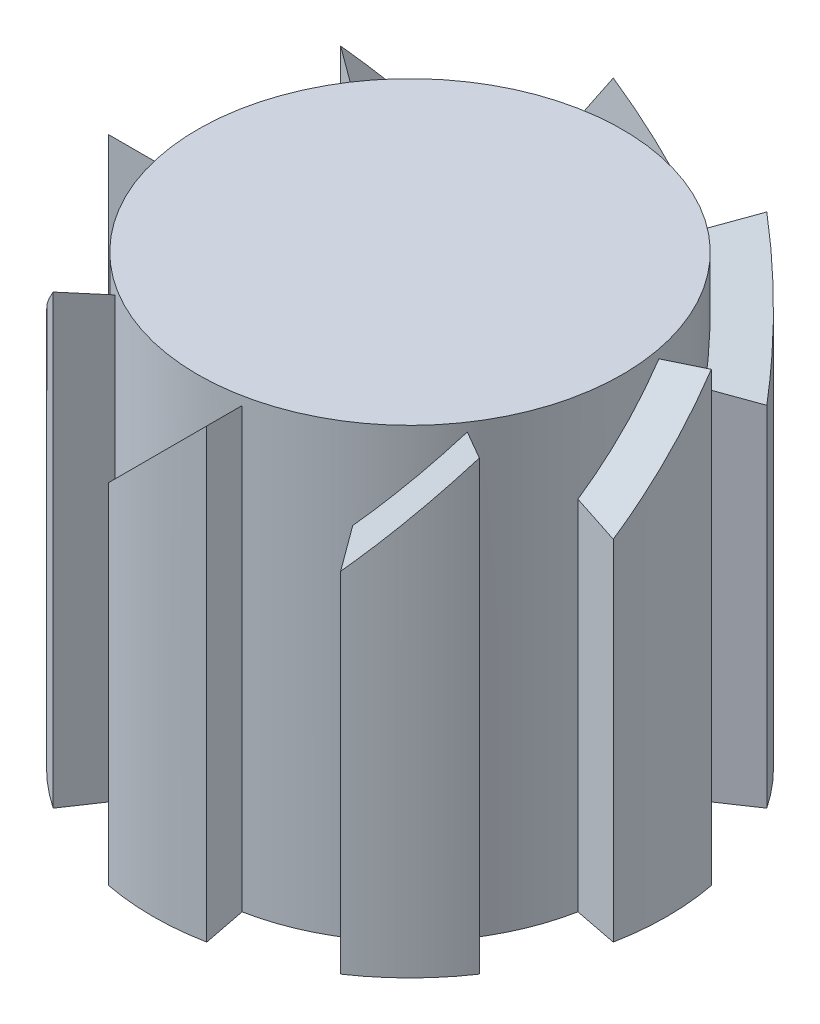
ISO-10303-21;
HEADER;
FILE_DESCRIPTION(('STEP AP214'),'2;1');
FILE_NAME('part.step','',(''),(''),'','','');
FILE_SCHEMA(('AUTOMOTIVE_DESIGN { 1 0 10303 214 1 1 1 1 }'));
ENDSEC;
DATA;
#1=APPLICATION_CONTEXT('core data for automotive mechanical design processes');
#2=APPLICATION_PROTOCOL_DEFINITION('international standard','automotive_design',2000,#1);
#3=PRODUCT_CONTEXT('',#1,'mechanical');
#4=PRODUCT('Part','Part','',(#3));
#5=PRODUCT_RELATED_PRODUCT_CATEGORY('part','',(#4));
#6=PRODUCT_DEFINITION_FORMATION('','',#4);
#7=PRODUCT_DEFINITION_CONTEXT('part definition',#1,'design');
#8=PRODUCT_DEFINITION('design','',#6,#7);
#9=PRODUCT_DEFINITION_SHAPE('','',#8);
#10=(LENGTH_UNIT() NAMED_UNIT(*) SI_UNIT(.MILLI.,.METRE.));
#11=(NAMED_UNIT(*) PLANE_ANGLE_UNIT() SI_UNIT($,.RADIAN.));
#12=(NAMED_UNIT(*) SI_UNIT($,.STERADIAN.) SOLID_ANGLE_UNIT());
#13=UNCERTAINTY_MEASURE_WITH_UNIT(LENGTH_MEASURE(1.E-05),#10,'distance_accuracy_value','');
#14=(GEOMETRIC_REPRESENTATION_CONTEXT(3) GLOBAL_UNCERTAINTY_ASSIGNED_CONTEXT((#13)) GLOBAL_UNIT_ASSIGNED_CONTEXT((#10,
#11,#12)) REPRESENTATION_CONTEXT('',''));
#15=CARTESIAN_POINT('',(0.,0.,0.));
#16=DIRECTION('',(0.,0.,1.));
#17=DIRECTION('',(1.,0.,0.));
#18=AXIS2_PLACEMENT_3D('',#15,#16,#17);
#19=CARTESIAN_POINT('',(0.,10.,0.));
#20=DIRECTION('',(0.,-1.,0.));
#21=DIRECTION('',(0.,0.,-1.));
#22=AXIS2_PLACEMENT_3D('',#19,#20,#21);
#23=CYLINDRICAL_SURFACE('',#22,4.75);
#24=CARTESIAN_POINT('',(0.,10.,0.));
#25=DIRECTION('',(0.,1.,0.));
#26=DIRECTION('',(0.,0.,1.));
#27=AXIS2_PLACEMENT_3D('',#24,#25,#26);
#28=CIRCLE('',#27,4.75);
#29=CARTESIAN_POINT('',(0.,10.,4.75));
#30=VERTEX_POINT('',#29);
#31=EDGE_CURVE('E398',#30,#30,#28,.T.);
#32=ORIENTED_EDGE('',*,*,#31,.F.);
#33=EDGE_LOOP('',(#32));
#34=FACE_BOUND('',#33,.T.);
#35=CARTESIAN_POINT('',(0.,8.9028482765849,0.));
#36=DIRECTION('',(-0.499999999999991,-0.707106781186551,-0.500000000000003));
#37=DIRECTION('',(0.499999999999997,-0.707106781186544,0.500000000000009));
#38=AXIS2_PLACEMENT_3D('',#35,#36,#37);
#39=ELLIPSE('',#38,6.71751442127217,4.75);
#40=CARTESIAN_POINT('',(3.93792846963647,7.99650554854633,-2.65616629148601));
#41=VERTEX_POINT('',#40);
#42=CARTESIAN_POINT('',(2.65616629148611,9.80919100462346,-3.93792846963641));
#43=VERTEX_POINT('',#42);
#44=EDGE_CURVE('E238',#41,#43,#39,.F.);
#45=ORIENTED_EDGE('',*,*,#44,.T.);
#46=DIRECTION('',(0.,-1.,0.));
#47=VECTOR('',#46,1.);
#48=CARTESIAN_POINT('',(2.65616629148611,10.,-3.93792846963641));
#49=LINE('',#48,#47);
#50=CARTESIAN_POINT('',(2.65616629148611,0.,-3.93792846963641));
#51=VERTEX_POINT('',#50);
#52=EDGE_CURVE('E257',#43,#51,#49,.T.);
#53=ORIENTED_EDGE('',*,*,#52,.T.);
#54=CARTESIAN_POINT('',(0.,0.,0.));
#55=DIRECTION('',(0.,1.,0.));
#56=DIRECTION('',(0.,0.,1.));
#57=AXIS2_PLACEMENT_3D('',#54,#55,#56);
#58=CIRCLE('',#57,4.75);
#59=CARTESIAN_POINT('',(0.906342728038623,0.,-4.6627291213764));
#60=VERTEX_POINT('',#59);
#61=EDGE_CURVE('E403',#51,#60,#58,.T.);
#62=ORIENTED_EDGE('',*,*,#61,.T.);
#63=DIRECTION('',(0.,-1.,0.));
#64=VECTOR('',#63,1.);
#65=CARTESIAN_POINT('',(0.906342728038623,10.,-4.6627291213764));
#66=LINE('',#65,#64);
#67=CARTESIAN_POINT('',(0.906342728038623,7.99650554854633,-4.6627291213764));
#68=VERTEX_POINT('',#67);
#69=EDGE_CURVE('E271',#60,#68,#66,.F.);
#70=ORIENTED_EDGE('',*,*,#69,.T.);
#71=CARTESIAN_POINT('',(0.,8.9028482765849,0.));
#72=DIRECTION('',(-0.707106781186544,-0.707106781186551,0.));
#73=DIRECTION('',(0.707106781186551,-0.707106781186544,0.));
#74=AXIS2_PLACEMENT_3D('',#71,#72,#73);
#75=ELLIPSE('',#74,6.71751442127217,4.75);
#76=CARTESIAN_POINT('',(-0.906342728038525,9.80919100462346,-4.66272912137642));
#77=VERTEX_POINT('',#76);
#78=EDGE_CURVE('E514',#68,#77,#75,.F.);
#79=ORIENTED_EDGE('',*,*,#78,.T.);
#80=DIRECTION('',(0.,-1.,0.));
#81=VECTOR('',#80,1.);
#82=CARTESIAN_POINT('',(-0.906342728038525,10.,-4.66272912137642));
#83=LINE('',#82,#81);
#84=CARTESIAN_POINT('',(-0.906342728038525,0.,-4.66272912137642));
#85=VERTEX_POINT('',#84);
#86=EDGE_CURVE('E280',#77,#85,#83,.T.);
#87=ORIENTED_EDGE('',*,*,#86,.T.);
#88=CARTESIAN_POINT('',(-2.65616629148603,0.,-3.93792846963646));
#89=VERTEX_POINT('',#88);
#90=EDGE_CURVE('E434',#85,#89,#58,.T.);
#91=ORIENTED_EDGE('',*,*,#90,.T.);
#92=DIRECTION('',(0.,-1.,0.));
#93=VECTOR('',#92,1.);
#94=CARTESIAN_POINT('',(-2.65616629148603,10.,-3.93792846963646));
#95=LINE('',#94,#93);
#96=CARTESIAN_POINT('',(-2.65616629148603,7.99650554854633,-3.93792846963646));
#97=VERTEX_POINT('',#96);
#98=EDGE_CURVE('E293',#89,#97,#95,.F.);
#99=ORIENTED_EDGE('',*,*,#98,.T.);
#100=CARTESIAN_POINT('',(0.,8.9028482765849,0.));
#101=DIRECTION('',(-0.500000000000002,-0.707106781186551,0.499999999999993));
#102=DIRECTION('',(0.500000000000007,-0.707106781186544,-0.499999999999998));
#103=AXIS2_PLACEMENT_3D('',#100,#101,#102);
#104=ELLIPSE('',#103,6.71751442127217,4.75);
#105=CARTESIAN_POINT('',(-3.93792846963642,9.80919100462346,-2.65616629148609));
#106=VERTEX_POINT('',#105);
#107=EDGE_CURVE('E426',#97,#106,#104,.F.);
#108=ORIENTED_EDGE('',*,*,#107,.T.);
#109=DIRECTION('',(0.,-1.,0.));
#110=VECTOR('',#109,1.);
#111=CARTESIAN_POINT('',(-3.93792846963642,10.,-2.65616629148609));
#112=LINE('',#111,#110);
#113=CARTESIAN_POINT('',(-3.93792846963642,0.,-2.65616629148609));
#114=VERTEX_POINT('',#113);
#115=EDGE_CURVE('E298',#106,#114,#112,.T.);
#116=ORIENTED_EDGE('',*,*,#115,.T.);
#117=CARTESIAN_POINT('',(-4.66272912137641,0.,-0.906342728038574));
#118=VERTEX_POINT('',#117);
#119=EDGE_CURVE('E437',#114,#118,#58,.T.);
#120=ORIENTED_EDGE('',*,*,#119,.T.);
#121=DIRECTION('',(0.,-1.,0.));
#122=VECTOR('',#121,1.);
#123=CARTESIAN_POINT('',(-4.66272912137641,10.,-0.906342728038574));
#124=LINE('',#123,#122);
#125=CARTESIAN_POINT('',(-4.66272912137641,7.99650554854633,-0.906342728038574));
#126=VERTEX_POINT('',#125);
#127=EDGE_CURVE('E307',#118,#126,#124,.F.);
#128=ORIENTED_EDGE('',*,*,#127,.T.);
#129=CARTESIAN_POINT('',(0.,8.9028482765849,0.));
#130=DIRECTION('',(0.,-0.707106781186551,0.707106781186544));
#131=DIRECTION('',(0.,-0.707106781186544,-0.707106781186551));
#132=AXIS2_PLACEMENT_3D('',#129,#130,#131);
#133=ELLIPSE('',#132,6.71751442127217,4.75);
#134=CARTESIAN_POINT('',(-4.66272912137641,9.80919100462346,0.906342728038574));
#135=VERTEX_POINT('',#134);
#136=EDGE_CURVE('E504',#126,#135,#133,.F.);
#137=ORIENTED_EDGE('',*,*,#136,.T.);
#138=DIRECTION('',(0.,-1.,0.));
#139=VECTOR('',#138,1.);
#140=CARTESIAN_POINT('',(-4.66272912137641,10.,0.906342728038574));
#141=LINE('',#140,#139);
#142=CARTESIAN_POINT('',(-4.66272912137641,0.,0.906342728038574));
#143=VERTEX_POINT('',#142);
#144=EDGE_CURVE('E316',#135,#143,#141,.T.);
#145=ORIENTED_EDGE('',*,*,#144,.T.);
#146=CARTESIAN_POINT('',(-3.93792846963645,0.,2.65616629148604));
#147=VERTEX_POINT('',#146);
#148=EDGE_CURVE('E438',#143,#147,#58,.T.);
#149=ORIENTED_EDGE('',*,*,#148,.T.);
#150=DIRECTION('',(0.,-1.,0.));
#151=VECTOR('',#150,1.);
#152=CARTESIAN_POINT('',(-3.93792846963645,10.,2.65616629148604));
#153=LINE('',#152,#151);
#154=CARTESIAN_POINT('',(-3.93792846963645,7.99650554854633,2.65616629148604));
#155=VERTEX_POINT('',#154);
#156=EDGE_CURVE('E329',#147,#155,#153,.F.);
#157=ORIENTED_EDGE('',*,*,#156,.T.);
#158=CARTESIAN_POINT('',(0.,8.9028482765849,0.));
#159=DIRECTION('',(0.499999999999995,-0.707106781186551,0.5));
#160=DIRECTION('',(-0.5,-0.707106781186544,-0.500000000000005));
#161=AXIS2_PLACEMENT_3D('',#158,#159,#160);
#162=ELLIPSE('',#161,6.71751442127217,4.75);
#163=CARTESIAN_POINT('',(-2.65616629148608,9.80919100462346,3.93792846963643));
#164=VERTEX_POINT('',#163);
#165=EDGE_CURVE('E497',#155,#164,#162,.F.);
#166=ORIENTED_EDGE('',*,*,#165,.T.);
#167=DIRECTION('',(0.,-1.,0.));
#168=VECTOR('',#167,1.);
#169=CARTESIAN_POINT('',(-2.65616629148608,10.,3.93792846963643));
#170=LINE('',#169,#168);
#171=CARTESIAN_POINT('',(-2.65616629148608,0.,3.93792846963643));
#172=VERTEX_POINT('',#171);
#173=EDGE_CURVE('E334',#164,#172,#170,.T.);
#174=ORIENTED_EDGE('',*,*,#173,.T.);
#175=CARTESIAN_POINT('',(-0.90634272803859,0.,4.6627291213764));
#176=VERTEX_POINT('',#175);
#177=EDGE_CURVE('E441',#172,#176,#58,.T.);
#178=ORIENTED_EDGE('',*,*,#177,.T.);
#179=DIRECTION('',(0.,-1.,0.));
#180=VECTOR('',#179,1.);
#181=CARTESIAN_POINT('',(-0.90634272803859,10.,4.6627291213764));
#182=LINE('',#181,#180);
#183=CARTESIAN_POINT('',(-0.90634272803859,7.99650554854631,4.6627291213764));
#184=VERTEX_POINT('',#183);
#185=EDGE_CURVE('E343',#176,#184,#182,.F.);
#186=ORIENTED_EDGE('',*,*,#185,.T.);
#187=CARTESIAN_POINT('',(0.,8.90284827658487,0.));
#188=DIRECTION('',(0.707106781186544,-0.707106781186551,0.));
#189=DIRECTION('',(-0.707106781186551,-0.707106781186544,0.));
#190=AXIS2_PLACEMENT_3D('',#187,#188,#189);
#191=ELLIPSE('',#190,6.71751442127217,4.75);
#192=CARTESIAN_POINT('',(0.906342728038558,9.80919100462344,4.66272912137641));
#193=VERTEX_POINT('',#192);
#194=EDGE_CURVE('E490',#184,#193,#191,.F.);
#195=ORIENTED_EDGE('',*,*,#194,.T.);
#196=DIRECTION('',(0.,-1.,0.));
#197=VECTOR('',#196,1.);
#198=CARTESIAN_POINT('',(0.906342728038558,10.,4.66272912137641));
#199=LINE('',#198,#197);
#200=CARTESIAN_POINT('',(0.906342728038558,0.,4.66272912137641));
#201=VERTEX_POINT('',#200);
#202=EDGE_CURVE('E352',#193,#201,#199,.T.);
#203=ORIENTED_EDGE('',*,*,#202,.T.);
#204=CARTESIAN_POINT('',(2.65616629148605,0.,3.93792846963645));
#205=VERTEX_POINT('',#204);
#206=EDGE_CURVE('E444',#201,#205,#58,.T.);
#207=ORIENTED_EDGE('',*,*,#206,.T.);
#208=DIRECTION('',(0.,-1.,0.));
#209=VECTOR('',#208,1.);
#210=CARTESIAN_POINT('',(2.65616629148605,10.,3.93792846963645));
#211=LINE('',#210,#209);
#212=CARTESIAN_POINT('',(2.65616629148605,7.99650554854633,3.93792846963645));
#213=VERTEX_POINT('',#212);
#214=EDGE_CURVE('E365',#205,#213,#211,.F.);
#215=ORIENTED_EDGE('',*,*,#214,.T.);
#216=CARTESIAN_POINT('',(0.,8.9028482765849,0.));
#217=DIRECTION('',(0.499999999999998,-0.707106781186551,-0.499999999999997));
#218=DIRECTION('',(-0.500000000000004,-0.707106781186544,0.500000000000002));
#219=AXIS2_PLACEMENT_3D('',#216,#217,#218);
#220=ELLIPSE('',#219,6.71751442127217,4.75);
#221=CARTESIAN_POINT('',(3.93792846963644,9.80919100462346,2.65616629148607));
#222=VERTEX_POINT('',#221);
#223=EDGE_CURVE('E484',#213,#222,#220,.F.);
#224=ORIENTED_EDGE('',*,*,#223,.T.);
#225=DIRECTION('',(0.,-1.,0.));
#226=VECTOR('',#225,1.);
#227=CARTESIAN_POINT('',(3.93792846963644,10.,2.65616629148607));
#228=LINE('',#227,#226);
#229=CARTESIAN_POINT('',(3.93792846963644,0.,2.65616629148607));
#230=VERTEX_POINT('',#229);
#231=EDGE_CURVE('E370',#222,#230,#228,.T.);
#232=ORIENTED_EDGE('',*,*,#231,.T.);
#233=CARTESIAN_POINT('',(4.66272912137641,0.,0.906342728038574));
#234=VERTEX_POINT('',#233);
#235=EDGE_CURVE('E397',#230,#234,#58,.T.);
#236=ORIENTED_EDGE('',*,*,#235,.T.);
#237=DIRECTION('',(0.,-1.,0.));
#238=VECTOR('',#237,1.);
#239=CARTESIAN_POINT('',(4.66272912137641,10.,0.906342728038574));
#240=LINE('',#239,#238);
#241=CARTESIAN_POINT('',(4.66272912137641,7.99650554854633,0.906342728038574));
#242=VERTEX_POINT('',#241);
#243=EDGE_CURVE('E390',#234,#242,#240,.F.);
#244=ORIENTED_EDGE('',*,*,#243,.T.);
#245=CARTESIAN_POINT('',(0.,8.9028482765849,0.));
#246=DIRECTION('',(0.,-0.707106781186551,-0.707106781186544));
#247=DIRECTION('',(0.,-0.707106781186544,0.707106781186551));
#248=AXIS2_PLACEMENT_3D('',#245,#246,#247);
#249=ELLIPSE('',#248,6.71751442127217,4.75);
#250=CARTESIAN_POINT('',(4.66272912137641,9.80919100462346,-0.906342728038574));
#251=VERTEX_POINT('',#250);
#252=EDGE_CURVE('E372',#242,#251,#249,.F.);
#253=ORIENTED_EDGE('',*,*,#252,.T.);
#254=DIRECTION('',(0.,-1.,0.));
#255=VECTOR('',#254,1.);
#256=CARTESIAN_POINT('',(4.66272912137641,10.,-0.906342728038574));
#257=LINE('',#256,#255);
#258=CARTESIAN_POINT('',(4.66272912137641,0.,-0.906342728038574));
#259=VERTEX_POINT('',#258);
#260=EDGE_CURVE('E395',#251,#259,#257,.T.);
#261=ORIENTED_EDGE('',*,*,#260,.T.);
#262=CARTESIAN_POINT('',(3.93792846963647,0.,-2.65616629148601));
#263=VERTEX_POINT('',#262);
#264=EDGE_CURVE('E256',#259,#263,#58,.T.);
#265=ORIENTED_EDGE('',*,*,#264,.T.);
#266=DIRECTION('',(0.,-1.,0.));
#267=VECTOR('',#266,1.);
#268=CARTESIAN_POINT('',(3.93792846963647,10.,-2.65616629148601));
#269=LINE('',#268,#267);
#270=EDGE_CURVE('E250',#263,#41,#269,.F.);
#271=ORIENTED_EDGE('',*,*,#270,.T.);
#272=EDGE_LOOP('',(#45,#53,#62,#70,#79,#87,#91,#99,#108,#116,#120,#128,#137,#145,#149,#157,#166,
#174,#178,#186,#195,#203,#207,#215,#224,#232,#236,#244,#253,#261,#265,#271));
#273=FACE_BOUND('',#272,.T.);
#274=ADVANCED_FACE('F33',(#34,#273),#23,.T.);
#275=CARTESIAN_POINT('',(0.,10.,0.));
#276=DIRECTION('',(0.,1.,0.));
#277=DIRECTION('',(0.,0.,1.));
#278=AXIS2_PLACEMENT_3D('',#275,#276,#277);
#279=PLANE('',#278);
#280=ORIENTED_EDGE('',*,*,#31,.T.);
#281=EDGE_LOOP('',(#280));
#282=FACE_BOUND('',#281,.T.);
#283=ADVANCED_FACE('F531',(#282),#279,.T.);
#284=CARTESIAN_POINT('',(0.,0.,0.));
#285=DIRECTION('',(0.,1.,0.));
#286=DIRECTION('',(0.,0.,1.));
#287=AXIS2_PLACEMENT_3D('',#284,#285,#286);
#288=PLANE('',#287);
#289=ORIENTED_EDGE('',*,*,#61,.F.);
#290=DIRECTION('',(0.559192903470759,0.,-0.829037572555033));
#291=VECTOR('',#290,1.);
#292=CARTESIAN_POINT('',(3.21535919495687,0.,-4.76696604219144));
#293=LINE('',#292,#291);
#294=CARTESIAN_POINT('',(3.21535919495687,0.,-4.76696604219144));
#295=VERTEX_POINT('',#294);
#296=EDGE_CURVE('E475',#51,#295,#293,.T.);
#297=ORIENTED_EDGE('',*,*,#296,.T.);
#298=CARTESIAN_POINT('',(0.,0.,0.));
#299=DIRECTION('',(0.,-1.,0.));
#300=DIRECTION('',(-0.707106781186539,0.,-0.707106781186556));
#301=AXIS2_PLACEMENT_3D('',#298,#299,#300);
#302=CIRCLE('',#301,5.75);
#303=CARTESIAN_POINT('',(4.76696604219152,0.,-3.21535919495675));
#304=VERTEX_POINT('',#303);
#305=EDGE_CURVE('E474',#295,#304,#302,.T.);
#306=ORIENTED_EDGE('',*,*,#305,.T.);
#307=DIRECTION('',(-0.829037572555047,0.,0.559192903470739));
#308=VECTOR('',#307,1.);
#309=CARTESIAN_POINT('',(0.,0.,0.));
#310=LINE('',#309,#308);
#311=EDGE_CURVE('E472',#304,#263,#310,.T.);
#312=ORIENTED_EDGE('',*,*,#311,.T.);
#313=ORIENTED_EDGE('',*,*,#264,.F.);
#314=DIRECTION('',(0.981627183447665,0.,-0.190808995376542));
#315=VECTOR('',#314,1.);
#316=CARTESIAN_POINT('',(5.64435630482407,0.,-1.09715172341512));
#317=LINE('',#316,#315);
#318=CARTESIAN_POINT('',(5.64435630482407,0.,-1.09715172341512));
#319=VERTEX_POINT('',#318);
#320=EDGE_CURVE('E384',#259,#319,#317,.T.);
#321=ORIENTED_EDGE('',*,*,#320,.T.);
#322=CARTESIAN_POINT('',(0.,0.,0.));
#323=DIRECTION('',(0.,-1.,0.));
#324=DIRECTION('',(0.,0.,-1.));
#325=AXIS2_PLACEMENT_3D('',#322,#323,#324);
#326=CIRCLE('',#325,5.75);
#327=CARTESIAN_POINT('',(5.64435630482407,0.,1.09715172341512));
#328=VERTEX_POINT('',#327);
#329=EDGE_CURVE('E380',#319,#328,#326,.T.);
#330=ORIENTED_EDGE('',*,*,#329,.T.);
#331=DIRECTION('',(-0.981627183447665,0.,-0.190808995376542));
#332=VECTOR('',#331,1.);
#333=CARTESIAN_POINT('',(0.,0.,0.));
#334=LINE('',#333,#332);
#335=EDGE_CURVE('E379',#328,#234,#334,.T.);
#336=ORIENTED_EDGE('',*,*,#335,.T.);
#337=ORIENTED_EDGE('',*,*,#235,.F.);
#338=DIRECTION('',(0.829037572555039,0.,0.559192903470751));
#339=VECTOR('',#338,1.);
#340=CARTESIAN_POINT('',(4.76696604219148,0.,3.21535919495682));
#341=LINE('',#340,#339);
#342=CARTESIAN_POINT('',(4.76696604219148,0.,3.21535919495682));
#343=VERTEX_POINT('',#342);
#344=EDGE_CURVE('E359',#230,#343,#341,.T.);
#345=ORIENTED_EDGE('',*,*,#344,.T.);
#346=CARTESIAN_POINT('',(0.,0.,0.));
#347=DIRECTION('',(0.,-1.,0.));
#348=DIRECTION('',(0.707106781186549,0.,-0.707106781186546));
#349=AXIS2_PLACEMENT_3D('',#346,#347,#348);
#350=CIRCLE('',#349,5.75);
#351=CARTESIAN_POINT('',(3.2153591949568,0.,4.76696604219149));
#352=VERTEX_POINT('',#351);
#353=EDGE_CURVE('E355',#343,#352,#350,.T.);
#354=ORIENTED_EDGE('',*,*,#353,.T.);
#355=DIRECTION('',(-0.559192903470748,0.,-0.829037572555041));
#356=VECTOR('',#355,1.);
#357=CARTESIAN_POINT('',(0.,0.,0.));
#358=LINE('',#357,#356);
#359=EDGE_CURVE('E354',#352,#205,#358,.T.);
#360=ORIENTED_EDGE('',*,*,#359,.T.);
#361=ORIENTED_EDGE('',*,*,#206,.F.);
#362=DIRECTION('',(0.190808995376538,0.,0.981627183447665));
#363=VECTOR('',#362,1.);
#364=CARTESIAN_POINT('',(1.0971517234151,0.,5.64435630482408));
#365=LINE('',#364,#363);
#366=CARTESIAN_POINT('',(1.0971517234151,0.,5.64435630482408));
#367=VERTEX_POINT('',#366);
#368=EDGE_CURVE('E346',#201,#367,#365,.T.);
#369=ORIENTED_EDGE('',*,*,#368,.T.);
#370=CARTESIAN_POINT('',(0.,0.,0.));
#371=DIRECTION('',(0.,-1.,0.));
#372=DIRECTION('',(1.,0.,0.));
#373=AXIS2_PLACEMENT_3D('',#370,#371,#372);
#374=CIRCLE('',#373,5.75);
#375=CARTESIAN_POINT('',(-1.09715172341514,0.,5.64435630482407));
#376=VERTEX_POINT('',#375);
#377=EDGE_CURVE('E341',#367,#376,#374,.T.);
#378=ORIENTED_EDGE('',*,*,#377,.T.);
#379=DIRECTION('',(0.190808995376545,0.,-0.981627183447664));
#380=VECTOR('',#379,1.);
#381=CARTESIAN_POINT('',(0.,0.,0.));
#382=LINE('',#381,#380);
#383=EDGE_CURVE('E336',#376,#176,#382,.T.);
#384=ORIENTED_EDGE('',*,*,#383,.T.);
#385=ORIENTED_EDGE('',*,*,#177,.F.);
#386=DIRECTION('',(-0.559192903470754,0.,0.829037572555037));
#387=VECTOR('',#386,1.);
#388=CARTESIAN_POINT('',(-3.21535919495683,0.,4.76696604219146));
#389=LINE('',#388,#387);
#390=CARTESIAN_POINT('',(-3.21535919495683,0.,4.76696604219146));
#391=VERTEX_POINT('',#390);
#392=EDGE_CURVE('E323',#172,#391,#389,.T.);
#393=ORIENTED_EDGE('',*,*,#392,.T.);
#394=CARTESIAN_POINT('',(0.,0.,0.));
#395=DIRECTION('',(0.,-1.,0.));
#396=DIRECTION('',(0.707106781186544,0.,0.707106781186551));
#397=AXIS2_PLACEMENT_3D('',#394,#395,#396);
#398=CIRCLE('',#397,5.75);
#399=CARTESIAN_POINT('',(-4.7669660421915,0.,3.21535919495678));
#400=VERTEX_POINT('',#399);
#401=EDGE_CURVE('E319',#391,#400,#398,.T.);
#402=ORIENTED_EDGE('',*,*,#401,.T.);
#403=DIRECTION('',(0.829037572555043,0.,-0.559192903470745));
#404=VECTOR('',#403,1.);
#405=CARTESIAN_POINT('',(0.,0.,0.));
#406=LINE('',#405,#404);
#407=EDGE_CURVE('E318',#400,#147,#406,.T.);
#408=ORIENTED_EDGE('',*,*,#407,.T.);
#409=ORIENTED_EDGE('',*,*,#148,.F.);
#410=DIRECTION('',(-0.981627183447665,0.,0.190808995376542));
#411=VECTOR('',#410,1.);
#412=CARTESIAN_POINT('',(-5.64435630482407,0.,1.09715172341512));
#413=LINE('',#412,#411);
#414=CARTESIAN_POINT('',(-5.64435630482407,0.,1.09715172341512));
#415=VERTEX_POINT('',#414);
#416=EDGE_CURVE('E310',#143,#415,#413,.T.);
#417=ORIENTED_EDGE('',*,*,#416,.T.);
#418=CARTESIAN_POINT('',(0.,0.,0.));
#419=DIRECTION('',(0.,-1.,0.));
#420=DIRECTION('',(0.,0.,1.));
#421=AXIS2_PLACEMENT_3D('',#418,#419,#420);
#422=CIRCLE('',#421,5.75);
#423=CARTESIAN_POINT('',(-5.64435630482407,0.,-1.09715172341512));
#424=VERTEX_POINT('',#423);
#425=EDGE_CURVE('E305',#415,#424,#422,.T.);
#426=ORIENTED_EDGE('',*,*,#425,.T.);
#427=DIRECTION('',(0.981627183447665,0.,0.190808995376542));
#428=VECTOR('',#427,1.);
#429=CARTESIAN_POINT('',(0.,0.,0.));
#430=LINE('',#429,#428);
#431=EDGE_CURVE('E300',#424,#118,#430,.T.);
#432=ORIENTED_EDGE('',*,*,#431,.T.);
#433=ORIENTED_EDGE('',*,*,#119,.F.);
#434=DIRECTION('',(-0.829037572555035,0.,-0.559192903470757));
#435=VECTOR('',#434,1.);
#436=CARTESIAN_POINT('',(-4.76696604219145,0.,-3.21535919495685));
#437=LINE('',#436,#435);
#438=CARTESIAN_POINT('',(-4.76696604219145,0.,-3.21535919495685));
#439=VERTEX_POINT('',#438);
#440=EDGE_CURVE('E287',#114,#439,#437,.T.);
#441=ORIENTED_EDGE('',*,*,#440,.T.);
#442=CARTESIAN_POINT('',(0.,0.,0.));
#443=DIRECTION('',(0.,-1.,0.));
#444=DIRECTION('',(-0.707106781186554,0.,0.707106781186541));
#445=AXIS2_PLACEMENT_3D('',#442,#443,#444);
#446=CIRCLE('',#445,5.75);
#447=CARTESIAN_POINT('',(-3.21535919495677,0.,-4.76696604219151));
#448=VERTEX_POINT('',#447);
#449=EDGE_CURVE('E283',#439,#448,#446,.T.);
#450=ORIENTED_EDGE('',*,*,#449,.T.);
#451=DIRECTION('',(0.559192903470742,0.,0.829037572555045));
#452=VECTOR('',#451,1.);
#453=CARTESIAN_POINT('',(0.,0.,0.));
#454=LINE('',#453,#452);
#455=EDGE_CURVE('E282',#448,#89,#454,.T.);
#456=ORIENTED_EDGE('',*,*,#455,.T.);
#457=ORIENTED_EDGE('',*,*,#90,.F.);
#458=DIRECTION('',(-0.190808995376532,0.,-0.981627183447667));
#459=VECTOR('',#458,1.);
#460=CARTESIAN_POINT('',(-1.09715172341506,0.,-5.64435630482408));
#461=LINE('',#460,#459);
#462=CARTESIAN_POINT('',(-1.09715172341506,0.,-5.64435630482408));
#463=VERTEX_POINT('',#462);
#464=EDGE_CURVE('E274',#85,#463,#461,.T.);
#465=ORIENTED_EDGE('',*,*,#464,.T.);
#466=CARTESIAN_POINT('',(0.,0.,0.));
#467=DIRECTION('',(0.,-1.,0.));
#468=DIRECTION('',(-1.,0.,0.));
#469=AXIS2_PLACEMENT_3D('',#466,#467,#468);
#470=CIRCLE('',#469,5.75);
#471=CARTESIAN_POINT('',(1.09715172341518,0.,-5.64435630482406));
#472=VERTEX_POINT('',#471);
#473=EDGE_CURVE('E269',#463,#472,#470,.T.);
#474=ORIENTED_EDGE('',*,*,#473,.T.);
#475=DIRECTION('',(-0.190808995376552,0.,0.981627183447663));
#476=VECTOR('',#475,1.);
#477=CARTESIAN_POINT('',(0.,0.,0.));
#478=LINE('',#477,#476);
#479=EDGE_CURVE('E259',#472,#60,#478,.T.);
#480=ORIENTED_EDGE('',*,*,#479,.T.);
#481=EDGE_LOOP('',(#289,#297,#306,#312,#313,#321,#330,#336,#337,#345,#354,#360,#361,#369,#378,
#384,#385,#393,#402,#408,#409,#417,#426,#432,#433,#441,#450,#456,#457,#465,#474,#480));
#482=FACE_BOUND('',#481,.T.);
#483=ADVANCED_FACE('F432',(#482),#288,.F.);
#484=CARTESIAN_POINT('',(5.64435630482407,16.1544672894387,-1.09715172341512));
#485=DIRECTION('',(-0.190808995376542,0.,-0.981627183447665));
#486=DIRECTION('',(-0.981627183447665,0.,0.190808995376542));
#487=AXIS2_PLACEMENT_3D('',#484,#485,#486);
#488=PLANE('',#487);
#489=DIRECTION('',(-0.964231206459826,-0.187427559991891,0.187427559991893));
#490=VECTOR('',#489,1.);
#491=CARTESIAN_POINT('',(6.75661318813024,10.2162008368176,-1.31335256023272));
#492=LINE('',#491,#490);
#493=CARTESIAN_POINT('',(5.64435630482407,10.,-1.09715172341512));
#494=VERTEX_POINT('',#493);
#495=EDGE_CURVE('E377',#494,#251,#492,.T.);
#496=ORIENTED_EDGE('',*,*,#495,.F.);
#497=DIRECTION('',(0.,-1.,0.));
#498=VECTOR('',#497,1.);
#499=CARTESIAN_POINT('',(5.64435630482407,16.1544672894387,-1.09715172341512));
#500=LINE('',#499,#498);
#501=EDGE_CURVE('E383',#494,#319,#500,.T.);
#502=ORIENTED_EDGE('',*,*,#501,.T.);
#503=ORIENTED_EDGE('',*,*,#320,.F.);
#504=ORIENTED_EDGE('',*,*,#260,.F.);
#505=EDGE_LOOP('',(#496,#502,#503,#504));
#506=FACE_BOUND('',#505,.T.);
#507=ADVANCED_FACE('F470',(#506),#488,.T.);
#508=CARTESIAN_POINT('',(0.,16.1544672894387,0.));
#509=DIRECTION('',(-0.190808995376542,0.,0.981627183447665));
#510=DIRECTION('',(0.981627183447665,0.,0.190808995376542));
#511=AXIS2_PLACEMENT_3D('',#508,#509,#510);
#512=PLANE('',#511);
#513=DIRECTION('',(0.964231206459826,-0.187427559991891,0.187427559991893));
#514=VECTOR('',#513,1.);
#515=CARTESIAN_POINT('',(-1.31053798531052,9.15759105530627,-0.254742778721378));
#516=LINE('',#515,#514);
#517=CARTESIAN_POINT('',(5.64435630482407,7.80569655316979,1.09715172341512));
#518=VERTEX_POINT('',#517);
#519=EDGE_CURVE('E375',#242,#518,#516,.T.);
#520=ORIENTED_EDGE('',*,*,#519,.F.);
#521=ORIENTED_EDGE('',*,*,#243,.F.);
#522=ORIENTED_EDGE('',*,*,#335,.F.);
#523=DIRECTION('',(0.,-1.,0.));
#524=VECTOR('',#523,1.);
#525=CARTESIAN_POINT('',(5.64435630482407,16.1544672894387,1.09715172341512));
#526=LINE('',#525,#524);
#527=EDGE_CURVE('E388',#518,#328,#526,.T.);
#528=ORIENTED_EDGE('',*,*,#527,.F.);
#529=EDGE_LOOP('',(#520,#521,#522,#528));
#530=FACE_BOUND('',#529,.T.);
#531=ADVANCED_FACE('F457',(#530),#512,.T.);
#532=CARTESIAN_POINT('',(0.,16.1544672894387,0.));
#533=DIRECTION('',(0.,-1.,0.));
#534=DIRECTION('',(0.,0.,-1.));
#535=AXIS2_PLACEMENT_3D('',#532,#533,#534);
#536=CYLINDRICAL_SURFACE('',#535,5.75);
#537=CARTESIAN_POINT('',(0.,8.9028482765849,0.));
#538=DIRECTION('',(0.,-0.707106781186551,-0.707106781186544));
#539=DIRECTION('',(0.,-0.707106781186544,0.707106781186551));
#540=AXIS2_PLACEMENT_3D('',#537,#538,#539);
#541=ELLIPSE('',#540,8.13172798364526,5.75);
#542=EDGE_CURVE('E401',#518,#494,#541,.F.);
#543=ORIENTED_EDGE('',*,*,#542,.F.);
#544=ORIENTED_EDGE('',*,*,#527,.T.);
#545=ORIENTED_EDGE('',*,*,#329,.F.);
#546=ORIENTED_EDGE('',*,*,#501,.F.);
#547=EDGE_LOOP('',(#543,#544,#545,#546));
#548=FACE_BOUND('',#547,.T.);
#549=ADVANCED_FACE('F464',(#548),#536,.T.);
#550=CARTESIAN_POINT('',(-4.751,7.80569655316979,1.09715172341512));
#551=DIRECTION('',(0.,-0.707106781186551,-0.707106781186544));
#552=DIRECTION('',(0.,0.707106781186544,-0.707106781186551));
#553=AXIS2_PLACEMENT_3D('',#550,#551,#552);
#554=PLANE('',#553);
#555=ORIENTED_EDGE('',*,*,#495,.T.);
#556=ORIENTED_EDGE('',*,*,#252,.F.);
#557=ORIENTED_EDGE('',*,*,#519,.T.);
#558=ORIENTED_EDGE('',*,*,#542,.T.);
#559=EDGE_LOOP('',(#555,#556,#557,#558));
#560=FACE_BOUND('',#559,.T.);
#561=ADVANCED_FACE('F467',(#560),#554,.F.);
#562=CARTESIAN_POINT('',(4.76696604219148,16.7415080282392,3.21535919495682));
#563=DIRECTION('',(0.559192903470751,0.,-0.829037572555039));
#564=DIRECTION('',(-0.829037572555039,0.,-0.559192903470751));
#565=AXIS2_PLACEMENT_3D('',#562,#563,#564);
#566=PLANE('',#565);
#567=DIRECTION('',(-0.814345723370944,-0.187427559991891,-0.549283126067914));
#568=VECTOR('',#567,1.);
#569=CARTESIAN_POINT('',(5.79592802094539,10.2368230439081,3.90940281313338));
#570=LINE('',#569,#568);
#571=CARTESIAN_POINT('',(4.76696604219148,10.,3.21535919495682));
#572=VERTEX_POINT('',#571);
#573=EDGE_CURVE('E476',#572,#222,#570,.T.);
#574=ORIENTED_EDGE('',*,*,#573,.F.);
#575=DIRECTION('',(0.,-1.,0.));
#576=VECTOR('',#575,1.);
#577=CARTESIAN_POINT('',(4.76696604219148,16.7415080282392,3.21535919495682));
#578=LINE('',#577,#576);
#579=EDGE_CURVE('E358',#572,#343,#578,.T.);
#580=ORIENTED_EDGE('',*,*,#579,.T.);
#581=ORIENTED_EDGE('',*,*,#344,.F.);
#582=ORIENTED_EDGE('',*,*,#231,.F.);
#583=EDGE_LOOP('',(#574,#580,#581,#582));
#584=FACE_BOUND('',#583,.T.);
#585=ADVANCED_FACE('F551',(#584),#566,.T.);
#586=CARTESIAN_POINT('',(0.,16.7415080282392,0.));
#587=DIRECTION('',(-0.829037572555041,0.,0.559192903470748));
#588=DIRECTION('',(0.559192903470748,0.,0.829037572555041));
#589=AXIS2_PLACEMENT_3D('',#586,#587,#588);
#590=PLANE('',#589);
#591=DIRECTION('',(0.549283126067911,-0.187427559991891,0.814345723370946));
#592=VECTOR('',#591,1.);
#593=CARTESIAN_POINT('',(-0.806996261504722,9.1782132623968,-1.1964211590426));
#594=LINE('',#593,#592);
#595=CARTESIAN_POINT('',(3.2153591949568,7.80569655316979,4.76696604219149));
#596=VERTEX_POINT('',#595);
#597=EDGE_CURVE('E479',#213,#596,#594,.T.);
#598=ORIENTED_EDGE('',*,*,#597,.F.);
#599=ORIENTED_EDGE('',*,*,#214,.F.);
#600=ORIENTED_EDGE('',*,*,#359,.F.);
#601=DIRECTION('',(0.,-1.,0.));
#602=VECTOR('',#601,1.);
#603=CARTESIAN_POINT('',(3.2153591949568,16.7415080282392,4.76696604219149));
#604=LINE('',#603,#602);
#605=EDGE_CURVE('E363',#596,#352,#604,.T.);
#606=ORIENTED_EDGE('',*,*,#605,.F.);
#607=EDGE_LOOP('',(#598,#599,#600,#606));
#608=FACE_BOUND('',#607,.T.);
#609=ADVANCED_FACE('F554',(#608),#590,.T.);
#610=CARTESIAN_POINT('',(0.,16.7415080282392,0.));
#611=DIRECTION('',(0.,-1.,0.));
#612=DIRECTION('',(0.,0.,-1.));
#613=AXIS2_PLACEMENT_3D('',#610,#611,#612);
#614=CYLINDRICAL_SURFACE('',#613,5.75);
#615=CARTESIAN_POINT('',(0.,8.9028482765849,0.));
#616=DIRECTION('',(0.499999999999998,-0.707106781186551,-0.499999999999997));
#617=DIRECTION('',(-0.500000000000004,-0.707106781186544,0.500000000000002));
#618=AXIS2_PLACEMENT_3D('',#615,#616,#617);
#619=ELLIPSE('',#618,8.13172798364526,5.75);
#620=EDGE_CURVE('E405',#596,#572,#619,.F.);
#621=ORIENTED_EDGE('',*,*,#620,.F.);
#622=ORIENTED_EDGE('',*,*,#605,.T.);
#623=ORIENTED_EDGE('',*,*,#353,.F.);
#624=ORIENTED_EDGE('',*,*,#579,.F.);
#625=EDGE_LOOP('',(#621,#622,#623,#624));
#626=FACE_BOUND('',#625,.T.);
#627=ADVANCED_FACE('F556',(#626),#614,.T.);
#628=CARTESIAN_POINT('',(1.0971517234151,16.1544672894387,5.64435630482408));
#629=DIRECTION('',(0.981627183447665,0.,-0.190808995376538));
#630=DIRECTION('',(-0.190808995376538,0.,-0.981627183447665));
#631=AXIS2_PLACEMENT_3D('',#628,#629,#630);
#632=PLANE('',#631);
#633=DIRECTION('',(-0.18742755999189,-0.187427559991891,-0.964231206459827));
#634=VECTOR('',#633,1.);
#635=CARTESIAN_POINT('',(1.3133525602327,10.2162008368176,6.75661318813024));
#636=LINE('',#635,#634);
#637=CARTESIAN_POINT('',(1.09715172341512,10.,5.64435630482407));
#638=VERTEX_POINT('',#637);
#639=EDGE_CURVE('E486',#638,#193,#636,.T.);
#640=ORIENTED_EDGE('',*,*,#639,.F.);
#641=DIRECTION('',(0.,-1.,0.));
#642=VECTOR('',#641,1.);
#643=CARTESIAN_POINT('',(1.0971517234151,16.1544672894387,5.64435630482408));
#644=LINE('',#643,#642);
#645=EDGE_CURVE('E337',#638,#367,#644,.T.);
#646=ORIENTED_EDGE('',*,*,#645,.T.);
#647=ORIENTED_EDGE('',*,*,#368,.F.);
#648=ORIENTED_EDGE('',*,*,#202,.F.);
#649=EDGE_LOOP('',(#640,#646,#647,#648));
#650=FACE_BOUND('',#649,.T.);
#651=ADVANCED_FACE('F559',(#650),#632,.T.);
#652=CARTESIAN_POINT('',(0.,16.1544672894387,0.));
#653=DIRECTION('',(-0.981627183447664,0.,-0.190808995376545));
#654=DIRECTION('',(-0.190808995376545,0.,0.981627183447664));
#655=AXIS2_PLACEMENT_3D('',#652,#653,#654);
#656=PLANE('',#655);
#657=DIRECTION('',(-0.187427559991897,-0.187427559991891,0.964231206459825));
#658=VECTOR('',#657,1.);
#659=CARTESIAN_POINT('',(0.254742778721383,9.15759105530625,-1.31053798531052));
#660=LINE('',#659,#658);
#661=CARTESIAN_POINT('',(-1.09715172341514,7.80569655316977,5.64435630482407));
#662=VERTEX_POINT('',#661);
#663=EDGE_CURVE('E488',#184,#662,#660,.T.);
#664=ORIENTED_EDGE('',*,*,#663,.F.);
#665=ORIENTED_EDGE('',*,*,#185,.F.);
#666=ORIENTED_EDGE('',*,*,#383,.F.);
#667=DIRECTION('',(0.,-1.,0.));
#668=VECTOR('',#667,1.);
#669=CARTESIAN_POINT('',(-1.09715172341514,16.1544672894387,5.64435630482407));
#670=LINE('',#669,#668);
#671=EDGE_CURVE('E340',#662,#376,#670,.T.);
#672=ORIENTED_EDGE('',*,*,#671,.F.);
#673=EDGE_LOOP('',(#664,#665,#666,#672));
#674=FACE_BOUND('',#673,.T.);
#675=ADVANCED_FACE('F564',(#674),#656,.T.);
#676=CARTESIAN_POINT('',(0.,16.1544672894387,0.));
#677=DIRECTION('',(0.,-1.,0.));
#678=DIRECTION('',(0.,0.,-1.));
#679=AXIS2_PLACEMENT_3D('',#676,#677,#678);
#680=CYLINDRICAL_SURFACE('',#679,5.75);
#681=CARTESIAN_POINT('',(0.,8.90284827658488,0.));
#682=DIRECTION('',(0.707106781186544,-0.707106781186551,0.));
#683=DIRECTION('',(-0.707106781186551,-0.707106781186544,0.));
#684=AXIS2_PLACEMENT_3D('',#681,#682,#683);
#685=ELLIPSE('',#684,8.13172798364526,5.75);
#686=EDGE_CURVE('E407',#662,#638,#685,.F.);
#687=ORIENTED_EDGE('',*,*,#686,.F.);
#688=ORIENTED_EDGE('',*,*,#671,.T.);
#689=ORIENTED_EDGE('',*,*,#377,.F.);
#690=ORIENTED_EDGE('',*,*,#645,.F.);
#691=EDGE_LOOP('',(#687,#688,#689,#690));
#692=FACE_BOUND('',#691,.T.);
#693=ADVANCED_FACE('F567',(#692),#680,.T.);
#694=CARTESIAN_POINT('',(-3.21535919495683,16.7415080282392,4.76696604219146));
#695=DIRECTION('',(0.829037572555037,0.,0.559192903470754));
#696=DIRECTION('',(0.559192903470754,0.,-0.829037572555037));
#697=AXIS2_PLACEMENT_3D('',#694,#695,#696);
#698=PLANE('',#697);
#699=DIRECTION('',(0.549283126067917,-0.187427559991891,-0.814345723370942));
#700=VECTOR('',#699,1.);
#701=CARTESIAN_POINT('',(-3.9094028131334,10.2368230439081,5.79592802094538));
#702=LINE('',#701,#700);
#703=CARTESIAN_POINT('',(-3.21535919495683,10.,4.76696604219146));
#704=VERTEX_POINT('',#703);
#705=EDGE_CURVE('E493',#704,#164,#702,.T.);
#706=ORIENTED_EDGE('',*,*,#705,.F.);
#707=DIRECTION('',(0.,-1.,0.));
#708=VECTOR('',#707,1.);
#709=CARTESIAN_POINT('',(-3.21535919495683,16.7415080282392,4.76696604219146));
#710=LINE('',#709,#708);
#711=EDGE_CURVE('E322',#704,#391,#710,.T.);
#712=ORIENTED_EDGE('',*,*,#711,.T.);
#713=ORIENTED_EDGE('',*,*,#392,.F.);
#714=ORIENTED_EDGE('',*,*,#173,.F.);
#715=EDGE_LOOP('',(#706,#712,#713,#714));
#716=FACE_BOUND('',#715,.T.);
#717=ADVANCED_FACE('F571',(#716),#698,.T.);
#718=CARTESIAN_POINT('',(0.,16.7415080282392,0.));
#719=DIRECTION('',(-0.559192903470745,0.,-0.829037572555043));
#720=DIRECTION('',(-0.829037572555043,0.,0.559192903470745));
#721=AXIS2_PLACEMENT_3D('',#718,#719,#720);
#722=PLANE('',#721);
#723=DIRECTION('',(-0.814345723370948,-0.187427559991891,0.549283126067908));
#724=VECTOR('',#723,1.);
#725=CARTESIAN_POINT('',(1.1964211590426,9.1782132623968,-0.806996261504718));
#726=LINE('',#725,#724);
#727=CARTESIAN_POINT('',(-4.7669660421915,7.80569655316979,3.21535919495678));
#728=VERTEX_POINT('',#727);
#729=EDGE_CURVE('E495',#155,#728,#726,.T.);
#730=ORIENTED_EDGE('',*,*,#729,.F.);
#731=ORIENTED_EDGE('',*,*,#156,.F.);
#732=ORIENTED_EDGE('',*,*,#407,.F.);
#733=DIRECTION('',(0.,-1.,0.));
#734=VECTOR('',#733,1.);
#735=CARTESIAN_POINT('',(-4.7669660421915,16.7415080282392,3.21535919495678));
#736=LINE('',#735,#734);
#737=EDGE_CURVE('E327',#728,#400,#736,.T.);
#738=ORIENTED_EDGE('',*,*,#737,.F.);
#739=EDGE_LOOP('',(#730,#731,#732,#738));
#740=FACE_BOUND('',#739,.T.);
#741=ADVANCED_FACE('F578',(#740),#722,.T.);
#742=CARTESIAN_POINT('',(0.,16.7415080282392,0.));
#743=DIRECTION('',(0.,-1.,0.));
#744=DIRECTION('',(0.,0.,-1.));
#745=AXIS2_PLACEMENT_3D('',#742,#743,#744);
#746=CYLINDRICAL_SURFACE('',#745,5.75);
#747=CARTESIAN_POINT('',(0.,8.9028482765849,0.));
#748=DIRECTION('',(0.499999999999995,-0.707106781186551,0.5));
#749=DIRECTION('',(-0.5,-0.707106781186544,-0.500000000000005));
#750=AXIS2_PLACEMENT_3D('',#747,#748,#749);
#751=ELLIPSE('',#750,8.13172798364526,5.75);
#752=EDGE_CURVE('E409',#728,#704,#751,.F.);
#753=ORIENTED_EDGE('',*,*,#752,.F.);
#754=ORIENTED_EDGE('',*,*,#737,.T.);
#755=ORIENTED_EDGE('',*,*,#401,.F.);
#756=ORIENTED_EDGE('',*,*,#711,.F.);
#757=EDGE_LOOP('',(#753,#754,#755,#756));
#758=FACE_BOUND('',#757,.T.);
#759=ADVANCED_FACE('F580',(#758),#746,.T.);
#760=CARTESIAN_POINT('',(-5.64435630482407,16.1544672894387,1.09715172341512));
#761=DIRECTION('',(0.190808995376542,0.,0.981627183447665));
#762=DIRECTION('',(0.981627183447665,0.,-0.190808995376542));
#763=AXIS2_PLACEMENT_3D('',#760,#761,#762);
#764=PLANE('',#763);
#765=DIRECTION('',(0.964231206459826,-0.187427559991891,-0.187427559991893));
#766=VECTOR('',#765,1.);
#767=CARTESIAN_POINT('',(-6.75661318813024,10.2162008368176,1.31335256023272));
#768=LINE('',#767,#766);
#769=CARTESIAN_POINT('',(-5.64435630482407,10.,1.09715172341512));
#770=VERTEX_POINT('',#769);
#771=EDGE_CURVE('E500',#770,#135,#768,.T.);
#772=ORIENTED_EDGE('',*,*,#771,.F.);
#773=DIRECTION('',(0.,-1.,0.));
#774=VECTOR('',#773,1.);
#775=CARTESIAN_POINT('',(-5.64435630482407,16.1544672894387,1.09715172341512));
#776=LINE('',#775,#774);
#777=EDGE_CURVE('E301',#770,#415,#776,.T.);
#778=ORIENTED_EDGE('',*,*,#777,.T.);
#779=ORIENTED_EDGE('',*,*,#416,.F.);
#780=ORIENTED_EDGE('',*,*,#144,.F.);
#781=EDGE_LOOP('',(#772,#778,#779,#780));
#782=FACE_BOUND('',#781,.T.);
#783=ADVANCED_FACE('F583',(#782),#764,.T.);
#784=CARTESIAN_POINT('',(0.,16.1544672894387,0.));
#785=DIRECTION('',(0.190808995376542,0.,-0.981627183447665));
#786=DIRECTION('',(-0.981627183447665,0.,-0.190808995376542));
#787=AXIS2_PLACEMENT_3D('',#784,#785,#786);
#788=PLANE('',#787);
#789=DIRECTION('',(-0.964231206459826,-0.187427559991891,-0.187427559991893));
#790=VECTOR('',#789,1.);
#791=CARTESIAN_POINT('',(1.31053798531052,9.15759105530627,0.254742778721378));
#792=LINE('',#791,#790);
#793=CARTESIAN_POINT('',(-5.64435630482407,7.80569655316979,-1.09715172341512));
#794=VERTEX_POINT('',#793);
#795=EDGE_CURVE('E502',#126,#794,#792,.T.);
#796=ORIENTED_EDGE('',*,*,#795,.F.);
#797=ORIENTED_EDGE('',*,*,#127,.F.);
#798=ORIENTED_EDGE('',*,*,#431,.F.);
#799=DIRECTION('',(0.,-1.,0.));
#800=VECTOR('',#799,1.);
#801=CARTESIAN_POINT('',(-5.64435630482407,16.1544672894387,-1.09715172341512));
#802=LINE('',#801,#800);
#803=EDGE_CURVE('E304',#794,#424,#802,.T.);
#804=ORIENTED_EDGE('',*,*,#803,.F.);
#805=EDGE_LOOP('',(#796,#797,#798,#804));
#806=FACE_BOUND('',#805,.T.);
#807=ADVANCED_FACE('F588',(#806),#788,.T.);
#808=CARTESIAN_POINT('',(0.,16.1544672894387,0.));
#809=DIRECTION('',(0.,-1.,0.));
#810=DIRECTION('',(0.,0.,-1.));
#811=AXIS2_PLACEMENT_3D('',#808,#809,#810);
#812=CYLINDRICAL_SURFACE('',#811,5.75);
#813=CARTESIAN_POINT('',(0.,8.9028482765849,0.));
#814=DIRECTION('',(0.,-0.707106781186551,0.707106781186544));
#815=DIRECTION('',(0.,-0.707106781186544,-0.707106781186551));
#816=AXIS2_PLACEMENT_3D('',#813,#814,#815);
#817=ELLIPSE('',#816,8.13172798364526,5.75);
#818=EDGE_CURVE('E411',#794,#770,#817,.F.);
#819=ORIENTED_EDGE('',*,*,#818,.F.);
#820=ORIENTED_EDGE('',*,*,#803,.T.);
#821=ORIENTED_EDGE('',*,*,#425,.F.);
#822=ORIENTED_EDGE('',*,*,#777,.F.);
#823=EDGE_LOOP('',(#819,#820,#821,#822));
#824=FACE_BOUND('',#823,.T.);
#825=ADVANCED_FACE('F591',(#824),#812,.T.);
#826=CARTESIAN_POINT('',(-4.76696604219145,16.7415080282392,-3.21535919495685));
#827=DIRECTION('',(-0.559192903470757,0.,0.829037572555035));
#828=DIRECTION('',(0.829037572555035,0.,0.559192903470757));
#829=AXIS2_PLACEMENT_3D('',#826,#827,#828);
#830=PLANE('',#829);
#831=DIRECTION('',(0.81434572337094,-0.187427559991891,0.54928312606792));
#832=VECTOR('',#831,1.);
#833=CARTESIAN_POINT('',(-5.79592802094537,10.2368230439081,-3.90940281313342));
#834=LINE('',#833,#832);
#835=CARTESIAN_POINT('',(-4.76696604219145,10.,-3.21535919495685));
#836=VERTEX_POINT('',#835);
#837=EDGE_CURVE('E507',#836,#106,#834,.T.);
#838=ORIENTED_EDGE('',*,*,#837,.F.);
#839=DIRECTION('',(0.,-1.,0.));
#840=VECTOR('',#839,1.);
#841=CARTESIAN_POINT('',(-4.76696604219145,16.7415080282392,-3.21535919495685));
#842=LINE('',#841,#840);
#843=EDGE_CURVE('E286',#836,#439,#842,.T.);
#844=ORIENTED_EDGE('',*,*,#843,.T.);
#845=ORIENTED_EDGE('',*,*,#440,.F.);
#846=ORIENTED_EDGE('',*,*,#115,.F.);
#847=EDGE_LOOP('',(#838,#844,#845,#846));
#848=FACE_BOUND('',#847,.T.);
#849=ADVANCED_FACE('F595',(#848),#830,.T.);
#850=CARTESIAN_POINT('',(0.,16.7415080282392,0.));
#851=DIRECTION('',(0.829037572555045,0.,-0.559192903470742));
#852=DIRECTION('',(-0.559192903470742,0.,-0.829037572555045));
#853=AXIS2_PLACEMENT_3D('',#850,#851,#852);
#854=PLANE('',#853);
#855=DIRECTION('',(-0.549283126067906,-0.187427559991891,-0.81434572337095));
#856=VECTOR('',#855,1.);
#857=CARTESIAN_POINT('',(0.806996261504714,9.1782132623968,1.1964211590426));
#858=LINE('',#857,#856);
#859=CARTESIAN_POINT('',(-3.21535919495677,7.80569655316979,-4.76696604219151));
#860=VERTEX_POINT('',#859);
#861=EDGE_CURVE('E509',#97,#860,#858,.T.);
#862=ORIENTED_EDGE('',*,*,#861,.F.);
#863=ORIENTED_EDGE('',*,*,#98,.F.);
#864=ORIENTED_EDGE('',*,*,#455,.F.);
#865=DIRECTION('',(0.,-1.,0.));
#866=VECTOR('',#865,1.);
#867=CARTESIAN_POINT('',(-3.21535919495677,16.7415080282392,-4.76696604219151));
#868=LINE('',#867,#866);
#869=EDGE_CURVE('E291',#860,#448,#868,.T.);
#870=ORIENTED_EDGE('',*,*,#869,.F.);
#871=EDGE_LOOP('',(#862,#863,#864,#870));
#872=FACE_BOUND('',#871,.T.);
#873=ADVANCED_FACE('F602',(#872),#854,.T.);
#874=CARTESIAN_POINT('',(0.,16.7415080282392,0.));
#875=DIRECTION('',(0.,-1.,0.));
#876=DIRECTION('',(0.,0.,-1.));
#877=AXIS2_PLACEMENT_3D('',#874,#875,#876);
#878=CYLINDRICAL_SURFACE('',#877,5.75);
#879=CARTESIAN_POINT('',(0.,8.9028482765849,0.));
#880=DIRECTION('',(-0.500000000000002,-0.707106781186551,0.499999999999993));
#881=DIRECTION('',(0.500000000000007,-0.707106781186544,-0.499999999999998));
#882=AXIS2_PLACEMENT_3D('',#879,#880,#881);
#883=ELLIPSE('',#882,8.13172798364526,5.75);
#884=EDGE_CURVE('E413',#860,#836,#883,.F.);
#885=ORIENTED_EDGE('',*,*,#884,.F.);
#886=ORIENTED_EDGE('',*,*,#869,.T.);
#887=ORIENTED_EDGE('',*,*,#449,.F.);
#888=ORIENTED_EDGE('',*,*,#843,.F.);
#889=EDGE_LOOP('',(#885,#886,#887,#888));
#890=FACE_BOUND('',#889,.T.);
#891=ADVANCED_FACE('F527',(#890),#878,.T.);
#892=CARTESIAN_POINT('',(-1.09715172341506,16.1544672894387,-5.64435630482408));
#893=DIRECTION('',(-0.981627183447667,0.,0.190808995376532));
#894=DIRECTION('',(0.190808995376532,0.,0.981627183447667));
#895=AXIS2_PLACEMENT_3D('',#892,#893,#894);
#896=PLANE('',#895);
#897=DIRECTION('',(0.187427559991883,-0.187427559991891,0.964231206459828));
#898=VECTOR('',#897,1.);
#899=CARTESIAN_POINT('',(-1.31335256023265,10.2162008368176,-6.75661318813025));
#900=LINE('',#899,#898);
#901=CARTESIAN_POINT('',(-1.09715172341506,10.,-5.64435630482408));
#902=VERTEX_POINT('',#901);
#903=EDGE_CURVE('E416',#902,#77,#900,.T.);
#904=ORIENTED_EDGE('',*,*,#903,.F.);
#905=DIRECTION('',(0.,-1.,0.));
#906=VECTOR('',#905,1.);
#907=CARTESIAN_POINT('',(-1.09715172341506,16.1544672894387,-5.64435630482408));
#908=LINE('',#907,#906);
#909=EDGE_CURVE('E265',#902,#463,#908,.T.);
#910=ORIENTED_EDGE('',*,*,#909,.T.);
#911=ORIENTED_EDGE('',*,*,#464,.F.);
#912=ORIENTED_EDGE('',*,*,#86,.F.);
#913=EDGE_LOOP('',(#904,#910,#911,#912));
#914=FACE_BOUND('',#913,.T.);
#915=ADVANCED_FACE('F423',(#914),#896,.T.);
#916=CARTESIAN_POINT('',(0.,16.1544672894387,0.));
#917=DIRECTION('',(0.981627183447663,0.,0.190808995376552));
#918=DIRECTION('',(0.190808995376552,0.,-0.981627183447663));
#919=AXIS2_PLACEMENT_3D('',#916,#917,#918);
#920=PLANE('',#919);
#921=DIRECTION('',(0.187427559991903,-0.187427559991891,-0.964231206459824));
#922=VECTOR('',#921,1.);
#923=CARTESIAN_POINT('',(-0.254742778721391,9.15759105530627,1.31053798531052));
#924=LINE('',#923,#922);
#925=CARTESIAN_POINT('',(1.09715172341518,7.80569655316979,-5.64435630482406));
#926=VERTEX_POINT('',#925);
#927=EDGE_CURVE('E54',#68,#926,#924,.T.);
#928=ORIENTED_EDGE('',*,*,#927,.F.);
#929=ORIENTED_EDGE('',*,*,#69,.F.);
#930=ORIENTED_EDGE('',*,*,#479,.F.);
#931=DIRECTION('',(0.,-1.,0.));
#932=VECTOR('',#931,1.);
#933=CARTESIAN_POINT('',(1.09715172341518,16.1544672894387,-5.64435630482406));
#934=LINE('',#933,#932);
#935=EDGE_CURVE('E268',#926,#472,#934,.T.);
#936=ORIENTED_EDGE('',*,*,#935,.F.);
#937=EDGE_LOOP('',(#928,#929,#930,#936));
#938=FACE_BOUND('',#937,.T.);
#939=ADVANCED_FACE('F518',(#938),#920,.T.);
#940=CARTESIAN_POINT('',(0.,16.1544672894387,0.));
#941=DIRECTION('',(0.,-1.,0.));
#942=DIRECTION('',(0.,0.,-1.));
#943=AXIS2_PLACEMENT_3D('',#940,#941,#942);
#944=CYLINDRICAL_SURFACE('',#943,5.75);
#945=CARTESIAN_POINT('',(0.,8.9028482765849,0.));
#946=DIRECTION('',(-0.707106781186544,-0.707106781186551,0.));
#947=DIRECTION('',(0.707106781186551,-0.707106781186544,0.));
#948=AXIS2_PLACEMENT_3D('',#945,#946,#947);
#949=ELLIPSE('',#948,8.13172798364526,5.75);
#950=EDGE_CURVE('E40',#926,#902,#949,.F.);
#951=ORIENTED_EDGE('',*,*,#950,.F.);
#952=ORIENTED_EDGE('',*,*,#935,.T.);
#953=ORIENTED_EDGE('',*,*,#473,.F.);
#954=ORIENTED_EDGE('',*,*,#909,.F.);
#955=EDGE_LOOP('',(#951,#952,#953,#954));
#956=FACE_BOUND('',#955,.T.);
#957=ADVANCED_FACE('F428',(#956),#944,.T.);
#958=CARTESIAN_POINT('',(3.21535919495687,16.7415080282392,-4.76696604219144));
#959=DIRECTION('',(-0.829037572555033,0.,-0.559192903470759));
#960=DIRECTION('',(-0.559192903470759,0.,0.829037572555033));
#961=AXIS2_PLACEMENT_3D('',#958,#959,#960);
#962=PLANE('',#961);
#963=DIRECTION('',(-0.549283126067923,-0.187427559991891,0.814345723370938));
#964=VECTOR('',#963,1.);
#965=CARTESIAN_POINT('',(3.90940281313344,10.2368230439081,-5.79592802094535));
#966=LINE('',#965,#964);
#967=CARTESIAN_POINT('',(3.21535919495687,10.,-4.76696604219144));
#968=VERTEX_POINT('',#967);
#969=EDGE_CURVE('E241',#968,#43,#966,.T.);
#970=ORIENTED_EDGE('',*,*,#969,.F.);
#971=DIRECTION('',(0.,-1.,0.));
#972=VECTOR('',#971,1.);
#973=CARTESIAN_POINT('',(3.21535919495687,16.7415080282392,-4.76696604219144));
#974=LINE('',#973,#972);
#975=EDGE_CURVE('E261',#968,#295,#974,.T.);
#976=ORIENTED_EDGE('',*,*,#975,.T.);
#977=ORIENTED_EDGE('',*,*,#296,.F.);
#978=ORIENTED_EDGE('',*,*,#52,.F.);
#979=EDGE_LOOP('',(#970,#976,#977,#978));
#980=FACE_BOUND('',#979,.T.);
#981=ADVANCED_FACE('F525',(#980),#962,.T.);
#982=CARTESIAN_POINT('',(0.,16.7415080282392,0.));
#983=DIRECTION('',(0.559192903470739,0.,0.829037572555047));
#984=DIRECTION('',(0.829037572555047,0.,-0.559192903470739));
#985=AXIS2_PLACEMENT_3D('',#982,#983,#984);
#986=PLANE('',#985);
#987=DIRECTION('',(0.814345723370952,-0.187427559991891,-0.549283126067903));
#988=VECTOR('',#987,1.);
#989=CARTESIAN_POINT('',(-1.19642115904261,9.1782132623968,0.806996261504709));
#990=LINE('',#989,#988);
#991=CARTESIAN_POINT('',(4.76696604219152,7.80569655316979,-3.21535919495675));
#992=VERTEX_POINT('',#991);
#993=EDGE_CURVE('E46',#41,#992,#990,.T.);
#994=ORIENTED_EDGE('',*,*,#993,.F.);
#995=ORIENTED_EDGE('',*,*,#270,.F.);
#996=ORIENTED_EDGE('',*,*,#311,.F.);
#997=DIRECTION('',(0.,-1.,0.));
#998=VECTOR('',#997,1.);
#999=CARTESIAN_POINT('',(4.76696604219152,16.7415080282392,-3.21535919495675));
#1000=LINE('',#999,#998);
#1001=EDGE_CURVE('E252',#992,#304,#1000,.T.);
#1002=ORIENTED_EDGE('',*,*,#1001,.F.);
#1003=EDGE_LOOP('',(#994,#995,#996,#1002));
#1004=FACE_BOUND('',#1003,.T.);
#1005=ADVANCED_FACE('F248',(#1004),#986,.T.);
#1006=CARTESIAN_POINT('',(0.,16.7415080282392,0.));
#1007=DIRECTION('',(0.,-1.,0.));
#1008=DIRECTION('',(0.,0.,-1.));
#1009=AXIS2_PLACEMENT_3D('',#1006,#1007,#1008);
#1010=CYLINDRICAL_SURFACE('',#1009,5.75);
#1011=CARTESIAN_POINT('',(0.,8.9028482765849,0.));
#1012=DIRECTION('',(-0.499999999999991,-0.707106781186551,-0.500000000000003));
#1013=DIRECTION('',(0.499999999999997,-0.707106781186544,0.500000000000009));
#1014=AXIS2_PLACEMENT_3D('',#1011,#1012,#1013);
#1015=ELLIPSE('',#1014,8.13172798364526,5.75);
#1016=EDGE_CURVE('E11',#992,#968,#1015,.F.);
#1017=ORIENTED_EDGE('',*,*,#1016,.F.);
#1018=ORIENTED_EDGE('',*,*,#1001,.T.);
#1019=ORIENTED_EDGE('',*,*,#305,.F.);
#1020=ORIENTED_EDGE('',*,*,#975,.F.);
#1021=EDGE_LOOP('',(#1017,#1018,#1019,#1020));
#1022=FACE_BOUND('',#1021,.T.);
#1023=ADVANCED_FACE('F657',(#1022),#1010,.T.);
#1024=CARTESIAN_POINT('',(-6.52680342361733,7.80569655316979,-4.97519657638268));
#1025=DIRECTION('',(0.499999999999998,-0.707106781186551,-0.499999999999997));
#1026=DIRECTION('',(0.816496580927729,0.577350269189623,0.));
#1027=AXIS2_PLACEMENT_3D('',#1024,#1025,#1026);
#1028=PLANE('',#1027);
#1029=ORIENTED_EDGE('',*,*,#573,.T.);
#1030=ORIENTED_EDGE('',*,*,#223,.F.);
#1031=ORIENTED_EDGE('',*,*,#597,.T.);
#1032=ORIENTED_EDGE('',*,*,#620,.T.);
#1033=EDGE_LOOP('',(#1029,#1030,#1031,#1032));
#1034=FACE_BOUND('',#1033,.T.);
#1035=ADVANCED_FACE('F654',(#1034),#1028,.F.);
#1036=CARTESIAN_POINT('',(-1.09715172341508,7.80569655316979,-5.75100000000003));
#1037=DIRECTION('',(0.707106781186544,-0.707106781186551,0.));
#1038=DIRECTION('',(0.707106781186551,0.707106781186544,0.));
#1039=AXIS2_PLACEMENT_3D('',#1036,#1037,#1038);
#1040=PLANE('',#1039);
#1041=ORIENTED_EDGE('',*,*,#639,.T.);
#1042=ORIENTED_EDGE('',*,*,#194,.F.);
#1043=ORIENTED_EDGE('',*,*,#663,.T.);
#1044=ORIENTED_EDGE('',*,*,#686,.T.);
#1045=EDGE_LOOP('',(#1041,#1042,#1043,#1044));
#1046=FACE_BOUND('',#1045,.T.);
#1047=ADVANCED_FACE('F656',(#1046),#1040,.F.);
#1048=CARTESIAN_POINT('',(4.9751965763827,7.80569655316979,-6.52680342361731));
#1049=DIRECTION('',(0.499999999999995,-0.707106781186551,0.5));
#1050=DIRECTION('',(0.,-0.577350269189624,-0.816496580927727));
#1051=AXIS2_PLACEMENT_3D('',#1048,#1049,#1050);
#1052=PLANE('',#1051);
#1053=ORIENTED_EDGE('',*,*,#705,.T.);
#1054=ORIENTED_EDGE('',*,*,#165,.F.);
#1055=ORIENTED_EDGE('',*,*,#729,.T.);
#1056=ORIENTED_EDGE('',*,*,#752,.T.);
#1057=EDGE_LOOP('',(#1053,#1054,#1055,#1056));
#1058=FACE_BOUND('',#1057,.T.);
#1059=ADVANCED_FACE('F663',(#1058),#1052,.F.);
#1060=CARTESIAN_POINT('',(5.751,7.80569655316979,-1.09715172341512));
#1061=DIRECTION('',(0.,-0.707106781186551,0.707106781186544));
#1062=DIRECTION('',(0.,-0.707106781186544,-0.707106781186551));
#1063=AXIS2_PLACEMENT_3D('',#1060,#1061,#1062);
#1064=PLANE('',#1063);
#1065=ORIENTED_EDGE('',*,*,#771,.T.);
#1066=ORIENTED_EDGE('',*,*,#136,.F.);
#1067=ORIENTED_EDGE('',*,*,#795,.T.);
#1068=ORIENTED_EDGE('',*,*,#818,.T.);
#1069=EDGE_LOOP('',(#1065,#1066,#1067,#1068));
#1070=FACE_BOUND('',#1069,.T.);
#1071=ADVANCED_FACE('F708',(#1070),#1064,.F.);
#1072=CARTESIAN_POINT('',(6.52680342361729,7.80569655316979,4.97519657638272));
#1073=DIRECTION('',(-0.500000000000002,-0.707106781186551,0.499999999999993));
#1074=DIRECTION('',(0.816496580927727,-0.577350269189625,0.));
#1075=AXIS2_PLACEMENT_3D('',#1072,#1073,#1074);
#1076=PLANE('',#1075);
#1077=ORIENTED_EDGE('',*,*,#837,.T.);
#1078=ORIENTED_EDGE('',*,*,#107,.F.);
#1079=ORIENTED_EDGE('',*,*,#861,.T.);
#1080=ORIENTED_EDGE('',*,*,#884,.T.);
#1081=EDGE_LOOP('',(#1077,#1078,#1079,#1080));
#1082=FACE_BOUND('',#1081,.T.);
#1083=ADVANCED_FACE('F716',(#1082),#1076,.F.);
#1084=CARTESIAN_POINT('',(1.09715172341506,7.80569655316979,5.75100000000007));
#1085=DIRECTION('',(-0.707106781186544,-0.707106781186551,0.));
#1086=DIRECTION('',(0.707106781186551,-0.707106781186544,0.));
#1087=AXIS2_PLACEMENT_3D('',#1084,#1085,#1086);
#1088=PLANE('',#1087);
#1089=ORIENTED_EDGE('',*,*,#903,.T.);
#1090=ORIENTED_EDGE('',*,*,#78,.F.);
#1091=ORIENTED_EDGE('',*,*,#927,.T.);
#1092=ORIENTED_EDGE('',*,*,#950,.T.);
#1093=EDGE_LOOP('',(#1089,#1090,#1091,#1092));
#1094=FACE_BOUND('',#1093,.T.);
#1095=ADVANCED_FACE('F415',(#1094),#1088,.F.);
#1096=CARTESIAN_POINT('',(-4.97519657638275,7.80569655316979,6.52680342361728));
#1097=DIRECTION('',(-0.499999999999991,-0.707106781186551,-0.500000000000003));
#1098=DIRECTION('',(0.,0.577350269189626,-0.816496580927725));
#1099=AXIS2_PLACEMENT_3D('',#1096,#1097,#1098);
#1100=PLANE('',#1099);
#1101=ORIENTED_EDGE('',*,*,#969,.T.);
#1102=ORIENTED_EDGE('',*,*,#44,.F.);
#1103=ORIENTED_EDGE('',*,*,#993,.T.);
#1104=ORIENTED_EDGE('',*,*,#1016,.T.);
#1105=EDGE_LOOP('',(#1101,#1102,#1103,#1104));
#1106=FACE_BOUND('',#1105,.T.);
#1107=ADVANCED_FACE('F239',(#1106),#1100,.F.);
#1108=CLOSED_SHELL('',(#274,#283,#483,#507,#531,#549,#561,#585,#609,#627,#651,#675,#693,#717,
#741,#759,#783,#807,#825,#849,#873,#891,#915,#939,#957,#981,#1005,#1023,#1035,#1047,#1059,#1071,
#1083,#1095,#1107));
#1109=MANIFOLD_SOLID_BREP('B2',#1108);
#1110=ADVANCED_BREP_SHAPE_REPRESENTATION('',(#18,#1109),#14);
#1111=SHAPE_DEFINITION_REPRESENTATION(#9,#1110);
ENDSEC;
END-ISO-10303-21;
